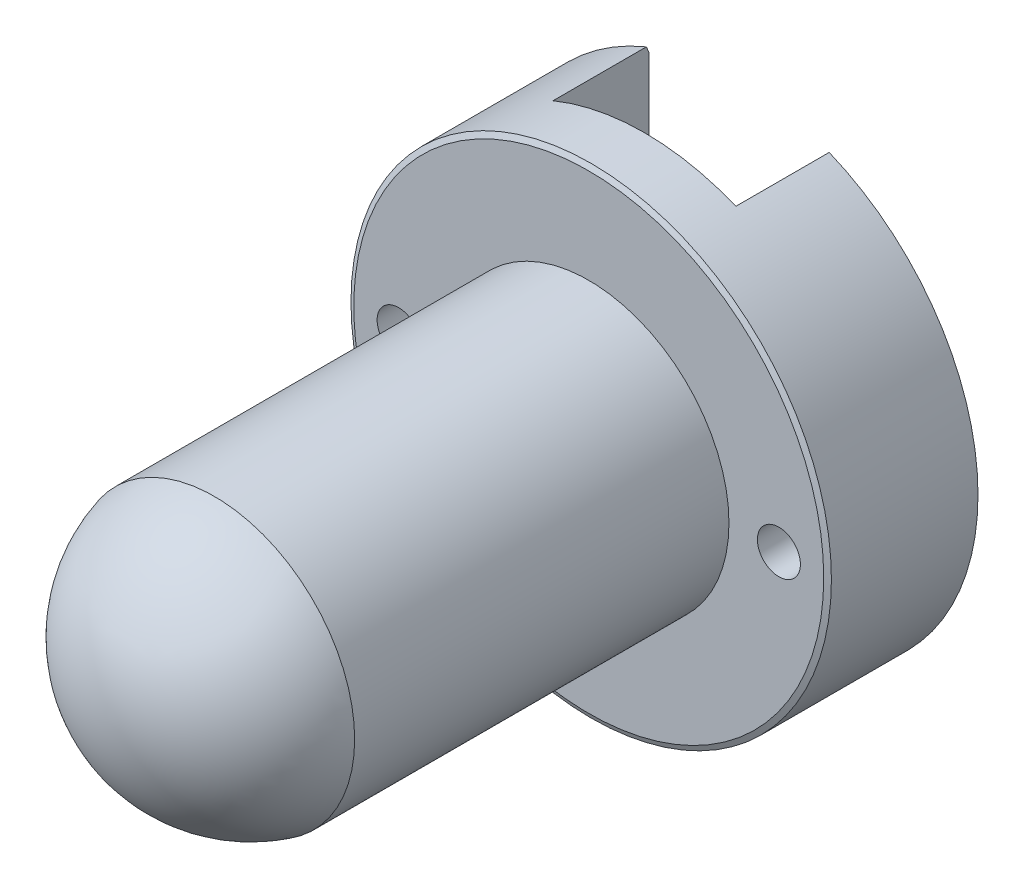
ISO-10303-21;
HEADER;
FILE_DESCRIPTION(('STEP AP214'),'2;1');
FILE_NAME('part.step','',(''),(''),'','','');
FILE_SCHEMA(('AUTOMOTIVE_DESIGN { 1 0 10303 214 1 1 1 1 }'));
ENDSEC;
DATA;
#1=APPLICATION_CONTEXT('core data for automotive mechanical design processes');
#2=APPLICATION_PROTOCOL_DEFINITION('international standard','automotive_design',2000,#1);
#3=PRODUCT_CONTEXT('',#1,'mechanical');
#4=PRODUCT('Part','Part','',(#3));
#5=PRODUCT_RELATED_PRODUCT_CATEGORY('part','',(#4));
#6=PRODUCT_DEFINITION_FORMATION('','',#4);
#7=PRODUCT_DEFINITION_CONTEXT('part definition',#1,'design');
#8=PRODUCT_DEFINITION('design','',#6,#7);
#9=PRODUCT_DEFINITION_SHAPE('','',#8);
#10=(LENGTH_UNIT() NAMED_UNIT(*) SI_UNIT(.MILLI.,.METRE.));
#11=(NAMED_UNIT(*) PLANE_ANGLE_UNIT() SI_UNIT($,.RADIAN.));
#12=(NAMED_UNIT(*) SI_UNIT($,.STERADIAN.) SOLID_ANGLE_UNIT());
#13=UNCERTAINTY_MEASURE_WITH_UNIT(LENGTH_MEASURE(1.E-05),#10,'distance_accuracy_value','');
#14=(GEOMETRIC_REPRESENTATION_CONTEXT(3) GLOBAL_UNCERTAINTY_ASSIGNED_CONTEXT((#13)) GLOBAL_UNIT_ASSIGNED_CONTEXT((#10,
#11,#12)) REPRESENTATION_CONTEXT('',''));
#15=CARTESIAN_POINT('',(0.,0.,0.));
#16=DIRECTION('',(0.,0.,1.));
#17=DIRECTION('',(1.,0.,0.));
#18=AXIS2_PLACEMENT_3D('',#15,#16,#17);
#19=CARTESIAN_POINT('',(0.,0.,23.622));
#20=DIRECTION('',(0.,0.,-1.));
#21=DIRECTION('',(-1.,0.,0.));
#22=AXIS2_PLACEMENT_3D('',#19,#20,#21);
#23=CYLINDRICAL_SURFACE('',#22,37.465);
#24=CARTESIAN_POINT('',(0.,0.,0.380999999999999));
#25=DIRECTION('',(0.,0.,1.));
#26=DIRECTION('',(1.,0.,0.));
#27=AXIS2_PLACEMENT_3D('',#24,#25,#26);
#28=CIRCLE('',#27,37.465);
#29=CARTESIAN_POINT('',(-14.2566195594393,34.6464287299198,0.380999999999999));
#30=VERTEX_POINT('',#29);
#31=CARTESIAN_POINT('',(14.2566195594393,34.6464287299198,0.380999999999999));
#32=VERTEX_POINT('',#31);
#33=EDGE_CURVE('E171',#30,#32,#28,.T.);
#34=ORIENTED_EDGE('',*,*,#33,.T.);
#35=DIRECTION('',(0.,0.,-1.));
#36=VECTOR('',#35,1.);
#37=CARTESIAN_POINT('',(14.2566195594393,34.6464287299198,23.622));
#38=LINE('',#37,#36);
#39=CARTESIAN_POINT('',(14.2566195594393,34.6464287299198,14.9352));
#40=VERTEX_POINT('',#39);
#41=EDGE_CURVE('E57',#32,#40,#38,.F.);
#42=ORIENTED_EDGE('',*,*,#41,.T.);
#43=CARTESIAN_POINT('',(0.,0.,14.9352));
#44=DIRECTION('',(0.,0.,1.));
#45=DIRECTION('',(1.,0.,0.));
#46=AXIS2_PLACEMENT_3D('',#43,#44,#45);
#47=CIRCLE('',#46,37.465);
#48=CARTESIAN_POINT('',(-14.2566195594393,34.6464287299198,14.9352));
#49=VERTEX_POINT('',#48);
#50=EDGE_CURVE('E11',#40,#49,#47,.T.);
#51=ORIENTED_EDGE('',*,*,#50,.T.);
#52=DIRECTION('',(0.,0.,-1.));
#53=VECTOR('',#52,1.);
#54=CARTESIAN_POINT('',(-14.2566195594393,34.6464287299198,23.622));
#55=LINE('',#54,#53);
#56=EDGE_CURVE('E137',#49,#30,#55,.T.);
#57=ORIENTED_EDGE('',*,*,#56,.T.);
#58=EDGE_LOOP('',(#34,#42,#51,#57));
#59=FACE_BOUND('',#58,.T.);
#60=CARTESIAN_POINT('',(0.,0.,23.241));
#61=DIRECTION('',(0.,0.,1.));
#62=DIRECTION('',(1.,0.,0.));
#63=AXIS2_PLACEMENT_3D('',#60,#61,#62);
#64=CIRCLE('',#63,37.465);
#65=CARTESIAN_POINT('',(37.465,0.,23.241));
#66=VERTEX_POINT('',#65);
#67=EDGE_CURVE('E168',#66,#66,#64,.F.);
#68=ORIENTED_EDGE('',*,*,#67,.T.);
#69=EDGE_LOOP('',(#68));
#70=FACE_BOUND('',#69,.T.);
#71=ADVANCED_FACE('F35',(#59,#70),#23,.T.);
#72=CARTESIAN_POINT('',(0.,0.,23.622));
#73=DIRECTION('',(0.,0.,1.));
#74=DIRECTION('',(1.,0.,0.));
#75=AXIS2_PLACEMENT_3D('',#72,#73,#74);
#76=PLANE('',#75);
#77=CARTESIAN_POINT('',(-29.6545,0.,23.622));
#78=DIRECTION('',(0.,0.,1.));
#79=DIRECTION('',(1.,0.,0.));
#80=AXIS2_PLACEMENT_3D('',#77,#78,#79);
#81=CIRCLE('',#80,3.3528);
#82=CARTESIAN_POINT('',(-26.3017,0.,23.622));
#83=VERTEX_POINT('',#82);
#84=EDGE_CURVE('E147',#83,#83,#81,.T.);
#85=ORIENTED_EDGE('',*,*,#84,.F.);
#86=EDGE_LOOP('',(#85));
#87=FACE_BOUND('',#86,.T.);
#88=CARTESIAN_POINT('',(29.6545,0.,23.622));
#89=DIRECTION('',(0.,0.,1.));
#90=DIRECTION('',(1.,0.,0.));
#91=AXIS2_PLACEMENT_3D('',#88,#89,#90);
#92=CIRCLE('',#91,3.3528);
#93=CARTESIAN_POINT('',(33.0073,0.,23.622));
#94=VERTEX_POINT('',#93);
#95=EDGE_CURVE('E153',#94,#94,#92,.T.);
#96=ORIENTED_EDGE('',*,*,#95,.F.);
#97=EDGE_LOOP('',(#96));
#98=FACE_BOUND('',#97,.T.);
#99=CARTESIAN_POINT('',(0.,0.,23.622));
#100=DIRECTION('',(0.,0.,1.));
#101=DIRECTION('',(1.,0.,0.));
#102=AXIS2_PLACEMENT_3D('',#99,#100,#101);
#103=CIRCLE('',#102,21.8694);
#104=CARTESIAN_POINT('',(21.8694,0.,23.622));
#105=VERTEX_POINT('',#104);
#106=EDGE_CURVE('E176',#105,#105,#103,.T.);
#107=ORIENTED_EDGE('',*,*,#106,.F.);
#108=EDGE_LOOP('',(#107));
#109=FACE_BOUND('',#108,.T.);
#110=CARTESIAN_POINT('',(0.,0.,23.622));
#111=DIRECTION('',(0.,0.,1.));
#112=DIRECTION('',(1.,0.,0.));
#113=AXIS2_PLACEMENT_3D('',#110,#111,#112);
#114=CIRCLE('',#113,36.6479428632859);
#115=CARTESIAN_POINT('',(36.6479428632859,0.,23.622));
#116=VERTEX_POINT('',#115);
#117=EDGE_CURVE('E165',#116,#116,#114,.T.);
#118=ORIENTED_EDGE('',*,*,#117,.T.);
#119=EDGE_LOOP('',(#118));
#120=FACE_BOUND('',#119,.T.);
#121=ADVANCED_FACE('F262',(#87,#98,#109,#120),#76,.T.);
#122=CARTESIAN_POINT('',(0.,0.,0.));
#123=DIRECTION('',(0.,0.,1.));
#124=DIRECTION('',(1.,0.,0.));
#125=AXIS2_PLACEMENT_3D('',#122,#123,#124);
#126=PLANE('',#125);
#127=CARTESIAN_POINT('',(-29.6545,0.,0.));
#128=DIRECTION('',(0.,0.,-1.));
#129=DIRECTION('',(1.,0.,0.));
#130=AXIS2_PLACEMENT_3D('',#127,#128,#129);
#131=CIRCLE('',#130,3.3528);
#132=CARTESIAN_POINT('',(-26.3017,0.,0.));
#133=VERTEX_POINT('',#132);
#134=EDGE_CURVE('E144',#133,#133,#131,.T.);
#135=ORIENTED_EDGE('',*,*,#134,.F.);
#136=EDGE_LOOP('',(#135));
#137=FACE_BOUND('',#136,.T.);
#138=CARTESIAN_POINT('',(29.6545,0.,0.));
#139=DIRECTION('',(0.,0.,-1.));
#140=DIRECTION('',(-1.,0.,0.));
#141=AXIS2_PLACEMENT_3D('',#138,#139,#140);
#142=CIRCLE('',#141,3.3528);
#143=CARTESIAN_POINT('',(26.3017,0.,0.));
#144=VERTEX_POINT('',#143);
#145=EDGE_CURVE('E150',#144,#144,#142,.T.);
#146=ORIENTED_EDGE('',*,*,#145,.F.);
#147=EDGE_LOOP('',(#146));
#148=FACE_BOUND('',#147,.T.);
#149=CARTESIAN_POINT('',(11.7166195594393,-10.6925712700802,0.));
#150=DIRECTION('',(0.,0.,-1.));
#151=DIRECTION('',(1.,0.,0.));
#152=AXIS2_PLACEMENT_3D('',#149,#150,#151);
#153=CIRCLE('',#152,2.54);
#154=CARTESIAN_POINT('',(14.2566195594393,-10.6925712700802,0.));
#155=VERTEX_POINT('',#154);
#156=CARTESIAN_POINT('',(11.7166195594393,-13.2325712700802,0.));
#157=VERTEX_POINT('',#156);
#158=EDGE_CURVE('E102',#155,#157,#153,.T.);
#159=ORIENTED_EDGE('',*,*,#158,.F.);
#160=DIRECTION('',(0.,-1.,0.));
#161=VECTOR('',#160,1.);
#162=CARTESIAN_POINT('',(14.2566195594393,40.4285272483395,0.));
#163=LINE('',#162,#161);
#164=CARTESIAN_POINT('',(14.2566195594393,33.7612279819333,0.));
#165=VERTEX_POINT('',#164);
#166=EDGE_CURVE('E93',#165,#155,#163,.T.);
#167=ORIENTED_EDGE('',*,*,#166,.F.);
#168=CARTESIAN_POINT('',(0.,0.,0.));
#169=DIRECTION('',(0.,0.,1.));
#170=DIRECTION('',(1.,0.,0.));
#171=AXIS2_PLACEMENT_3D('',#168,#169,#170);
#172=CIRCLE('',#171,36.6479428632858);
#173=CARTESIAN_POINT('',(-14.2566195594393,33.7612279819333,0.));
#174=VERTEX_POINT('',#173);
#175=EDGE_CURVE('E174',#165,#174,#172,.F.);
#176=ORIENTED_EDGE('',*,*,#175,.T.);
#177=DIRECTION('',(0.,1.,0.));
#178=VECTOR('',#177,1.);
#179=CARTESIAN_POINT('',(-14.2566195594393,40.4285272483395,0.));
#180=LINE('',#179,#178);
#181=CARTESIAN_POINT('',(-14.2566195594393,-10.6925712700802,0.));
#182=VERTEX_POINT('',#181);
#183=EDGE_CURVE('E49',#182,#174,#180,.T.);
#184=ORIENTED_EDGE('',*,*,#183,.F.);
#185=CARTESIAN_POINT('',(-11.7166195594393,-10.6925712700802,0.));
#186=DIRECTION('',(0.,0.,-1.));
#187=DIRECTION('',(-1.,0.,0.));
#188=AXIS2_PLACEMENT_3D('',#185,#186,#187);
#189=CIRCLE('',#188,2.54);
#190=CARTESIAN_POINT('',(-11.7166195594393,-13.2325712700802,0.));
#191=VERTEX_POINT('',#190);
#192=EDGE_CURVE('E118',#191,#182,#189,.T.);
#193=ORIENTED_EDGE('',*,*,#192,.F.);
#194=DIRECTION('',(-1.,0.,0.));
#195=VECTOR('',#194,1.);
#196=CARTESIAN_POINT('',(11.7166195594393,-13.2325712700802,0.));
#197=LINE('',#196,#195);
#198=EDGE_CURVE('E116',#157,#191,#197,.T.);
#199=ORIENTED_EDGE('',*,*,#198,.F.);
#200=EDGE_LOOP('',(#159,#167,#176,#184,#193,#199));
#201=FACE_BOUND('',#200,.T.);
#202=ADVANCED_FACE('F113',(#137,#148,#201),#126,.F.);
#203=CARTESIAN_POINT('',(0.,0.,23.622));
#204=DIRECTION('',(0.,0.,-1.));
#205=DIRECTION('',(-1.,0.,0.));
#206=AXIS2_PLACEMENT_3D('',#203,#204,#205);
#207=CONICAL_SURFACE('',#206,36.6479428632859,1.13446401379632);
#208=ORIENTED_EDGE('',*,*,#67,.F.);
#209=EDGE_LOOP('',(#208));
#210=FACE_BOUND('',#209,.T.);
#211=ORIENTED_EDGE('',*,*,#117,.F.);
#212=EDGE_LOOP('',(#211));
#213=FACE_BOUND('',#212,.T.);
#214=ADVANCED_FACE('F296',(#210,#213),#207,.T.);
#215=CARTESIAN_POINT('',(0.,0.,0.380999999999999));
#216=DIRECTION('',(0.,0.,1.));
#217=DIRECTION('',(1.,0.,0.));
#218=AXIS2_PLACEMENT_3D('',#215,#216,#217);
#219=CONICAL_SURFACE('',#218,37.465,1.13446401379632);
#220=CARTESIAN_POINT('',(14.2566195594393,66.3606470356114,14.5613164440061));
#221=CARTESIAN_POINT('',(14.2566195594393,64.6380920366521,13.7760422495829));
#222=CARTESIAN_POINT('',(14.2566195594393,62.9150608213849,12.9918090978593));
#223=CARTESIAN_POINT('',(14.2566195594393,59.4676862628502,11.4261750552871));
#224=CARTESIAN_POINT('',(14.2566195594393,57.7433429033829,10.6447742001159));
#225=CARTESIAN_POINT('',(14.2566195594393,54.2911616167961,9.08473144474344));
#226=CARTESIAN_POINT('',(14.2566195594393,52.563321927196,8.30609344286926));
#227=CARTESIAN_POINT('',(14.2566195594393,49.1055197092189,6.75358400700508));
#228=CARTESIAN_POINT('',(14.2566195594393,47.3755572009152,5.97971252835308));
#229=CARTESIAN_POINT('',(14.2566195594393,44.6655491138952,4.77349228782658));
#230=CARTESIAN_POINT('',(14.2566195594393,43.6864814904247,4.33894653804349));
#231=CARTESIAN_POINT('',(14.2566195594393,41.7272437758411,3.47234817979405));
#232=CARTESIAN_POINT('',(14.2566195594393,40.7470736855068,3.04029556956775));
#233=CARTESIAN_POINT('',(14.2566195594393,38.785370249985,2.17920369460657));
#234=CARTESIAN_POINT('',(14.2566195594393,37.8038368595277,1.75016453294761));
#235=CARTESIAN_POINT('',(14.2566195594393,35.839148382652,0.895816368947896));
#236=CARTESIAN_POINT('',(14.2566195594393,34.8559932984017,0.470507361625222));
#237=CARTESIAN_POINT('',(14.2566195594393,32.8885343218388,-0.375086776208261));
#238=CARTESIAN_POINT('',(14.2566195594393,31.9042321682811,-0.795375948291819));
#239=CARTESIAN_POINT('',(14.2566195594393,29.9331220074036,-1.63006235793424));
#240=CARTESIAN_POINT('',(14.2566195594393,28.9463139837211,-2.04445955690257));
#241=CARTESIAN_POINT('',(14.2566195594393,26.9695824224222,-2.86562685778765));
#242=CARTESIAN_POINT('',(14.2566195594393,25.9796590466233,-3.27239734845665));
#243=CARTESIAN_POINT('',(14.2566195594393,23.9957658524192,-4.07592346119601));
#244=CARTESIAN_POINT('',(14.2566195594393,23.0017961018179,-4.47267925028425));
#245=CARTESIAN_POINT('',(14.2566195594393,21.0840529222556,-5.22320136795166));
#246=CARTESIAN_POINT('',(14.2566195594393,20.1606649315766,-5.57794767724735));
#247=CARTESIAN_POINT('',(14.2566195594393,18.7712219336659,-6.09844886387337));
#248=CARTESIAN_POINT('',(14.2566195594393,18.3073432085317,-6.27001438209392));
#249=CARTESIAN_POINT('',(14.2566195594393,17.3779273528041,-6.60860274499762));
#250=CARTESIAN_POINT('',(14.2566195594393,16.9123902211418,-6.77562558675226));
#251=CARTESIAN_POINT('',(14.2566195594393,15.9782805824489,-7.10475555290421));
#252=CARTESIAN_POINT('',(14.2566195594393,15.5097034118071,-7.26684946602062));
#253=CARTESIAN_POINT('',(14.2566195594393,14.5704089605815,-7.58473148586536));
#254=CARTESIAN_POINT('',(14.2566195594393,14.0996916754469,-7.74051957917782));
#255=CARTESIAN_POINT('',(14.2566195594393,13.1558084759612,-8.04464961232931));
#256=CARTESIAN_POINT('',(14.2566195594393,12.6826423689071,-8.19299095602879));
#257=CARTESIAN_POINT('',(14.2566195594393,11.7336213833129,-8.48082912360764));
#258=CARTESIAN_POINT('',(14.2566195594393,11.2577665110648,-8.62032596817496));
#259=CARTESIAN_POINT('',(14.2566195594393,10.3233982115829,-8.88311706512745));
#260=CARTESIAN_POINT('',(14.2566195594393,9.86500860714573,-9.00684820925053));
#261=CARTESIAN_POINT('',(14.2566195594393,8.94534912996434,-9.24300123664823));
#262=CARTESIAN_POINT('',(14.2566195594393,8.48407925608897,-9.35542311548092));
#263=CARTESIAN_POINT('',(14.2566195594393,7.09562559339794,-9.67289297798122));
#264=CARTESIAN_POINT('',(14.2566195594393,6.16367600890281,-9.85818044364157));
#265=CARTESIAN_POINT('',(14.2566195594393,4.76012948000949,-10.0834409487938));
#266=CARTESIAN_POINT('',(14.2566195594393,4.29268124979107,-10.1496351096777));
#267=CARTESIAN_POINT('',(14.2566195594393,3.35543601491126,-10.2628577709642));
#268=CARTESIAN_POINT('',(14.2566195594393,2.88563904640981,-10.3098865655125));
#269=CARTESIAN_POINT('',(14.2566195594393,1.94459534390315,-10.3831741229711));
#270=CARTESIAN_POINT('',(14.2566195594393,1.47334923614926,-10.409440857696));
#271=CARTESIAN_POINT('',(14.2566195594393,0.530140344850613,-10.4402682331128));
#272=CARTESIAN_POINT('',(14.2566195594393,0.0581775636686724,-10.4448289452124));
#273=CARTESIAN_POINT('',(14.2566195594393,-0.898390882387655,-10.4318920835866));
#274=CARTESIAN_POINT('',(14.2566195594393,-1.38298831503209,-10.4137861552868));
#275=CARTESIAN_POINT('',(14.2566195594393,-2.35081965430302,-10.3551907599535));
#276=CARTESIAN_POINT('',(14.2566195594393,-2.83405353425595,-10.3147008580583));
#277=CARTESIAN_POINT('',(14.2566195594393,-3.79852287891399,-10.2128122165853));
#278=CARTESIAN_POINT('',(14.2566195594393,-4.27975726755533,-10.1514034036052));
#279=CARTESIAN_POINT('',(14.2566195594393,-5.23941490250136,-10.0096983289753));
#280=CARTESIAN_POINT('',(14.2566195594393,-5.71783811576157,-9.92940184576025));
#281=CARTESIAN_POINT('',(14.2566195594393,-6.67453150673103,-9.75161946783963));
#282=CARTESIAN_POINT('',(14.2566195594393,-7.15278224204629,-9.65402981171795));
#283=CARTESIAN_POINT('',(14.2566195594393,-8.10605885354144,-9.44429137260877));
#284=CARTESIAN_POINT('',(14.2566195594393,-8.58108472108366,-9.33214255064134));
#285=CARTESIAN_POINT('',(14.2566195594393,-9.5279625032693,-9.09542535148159));
#286=CARTESIAN_POINT('',(14.2566195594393,-9.9998147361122,-8.97085823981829));
#287=CARTESIAN_POINT('',(14.2566195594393,-10.9405952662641,-8.71118356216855));
#288=CARTESIAN_POINT('',(14.2566195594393,-11.409523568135,-8.57607601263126));
#289=CARTESIAN_POINT('',(14.2566195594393,-12.3598346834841,-8.29243453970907));
#290=CARTESIAN_POINT('',(14.2566195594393,-12.8411297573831,-8.14360769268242));
#291=CARTESIAN_POINT('',(14.2566195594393,-13.8011693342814,-7.83796769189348));
#292=CARTESIAN_POINT('',(14.2566195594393,-14.2799138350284,-7.68115453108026));
#293=CARTESIAN_POINT('',(14.2566195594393,-15.2351146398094,-7.36080674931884));
#294=CARTESIAN_POINT('',(14.2566195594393,-15.7115710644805,-7.19727248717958));
#295=CARTESIAN_POINT('',(14.2566195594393,-16.662487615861,-6.86451349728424));
#296=CARTESIAN_POINT('',(14.2566195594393,-17.1369477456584,-6.69528877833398));
#297=CARTESIAN_POINT('',(14.2566195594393,-18.0828499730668,-6.35246535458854));
#298=CARTESIAN_POINT('',(14.2566195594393,-18.5542967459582,-6.17887952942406));
#299=CARTESIAN_POINT('',(14.2566195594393,-19.4956581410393,-5.8275981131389));
#300=CARTESIAN_POINT('',(14.2566195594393,-19.9655727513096,-5.64990249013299));
#301=CARTESIAN_POINT('',(14.2566195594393,-21.3732834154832,-5.11156104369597));
#302=CARTESIAN_POINT('',(14.2566195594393,-22.3090681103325,-4.745652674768));
#303=CARTESIAN_POINT('',(14.2566195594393,-23.9443355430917,-4.09563322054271));
#304=CARTESIAN_POINT('',(14.2566195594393,-24.6447293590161,-3.81380129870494));
#305=CARTESIAN_POINT('',(14.2566195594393,-26.0435515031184,-3.24529652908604));
#306=CARTESIAN_POINT('',(14.2566195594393,-26.7419798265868,-2.95862366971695));
#307=CARTESIAN_POINT('',(14.2566195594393,-28.1376104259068,-2.38112436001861));
#308=CARTESIAN_POINT('',(14.2566195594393,-28.8348117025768,-2.0902954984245));
#309=CARTESIAN_POINT('',(14.2566195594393,-30.227822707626,-1.50532338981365));
#310=CARTESIAN_POINT('',(14.2566195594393,-30.9236324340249,-1.21118013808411));
#311=CARTESIAN_POINT('',(14.2566195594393,-32.2849790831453,-0.632478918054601));
#312=CARTESIAN_POINT('',(14.2566195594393,-32.9505644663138,-0.348034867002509));
#313=CARTESIAN_POINT('',(14.2566195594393,-34.2808004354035,0.223029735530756));
#314=CARTESIAN_POINT('',(14.2566195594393,-34.9454510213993,0.509650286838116));
#315=CARTESIAN_POINT('',(14.2566195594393,-36.2735247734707,1.08457544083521));
#316=CARTESIAN_POINT('',(14.2566195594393,-36.9369484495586,1.37287886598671));
#317=CARTESIAN_POINT('',(14.2566195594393,-38.2630882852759,1.9511039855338));
#318=CARTESIAN_POINT('',(14.2566195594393,-38.9258044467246,2.24102567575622));
#319=CARTESIAN_POINT('',(14.2566195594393,-39.5882183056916,2.53163475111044));
#320=B_SPLINE_CURVE_WITH_KNOTS('',3,(#220,#221,#222,#223,#224,#225,#226,#227,#228,#229,#230,
#231,#232,#233,#234,#235,#236,#237,#238,#239,#240,#241,#242,#243,#244,#245,#246,#247,#248,#249,
#250,#251,#252,#253,#254,#255,#256,#257,#258,#259,#260,#261,#262,#263,#264,#265,#266,#267,#268,
#269,#270,#271,#272,#273,#274,#275,#276,#277,#278,#279,#280,#281,#282,#283,#284,#285,#286,#287,
#288,#289,#290,#291,#292,#293,#294,#295,#296,#297,#298,#299,#300,#301,#302,#303,#304,#305,#306,
#307,#308,#309,#310,#311,#312,#313,#314,#315,#316,#317,#318,#319),.UNSPECIFIED.,.F.,.F.,(4,2,2,
2,2,2,2,2,2,2,2,2,2,2,2,2,2,2,2,2,2,2,2,2,2,2,2,2,2,2,2,2,2,2,2,2,2,2,2,2,2,2,2,2,2,2,2,2,2,4),
(0.,5.67932068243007,11.3587126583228,17.0442476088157,22.7297292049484,25.9432340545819,
29.1567366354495,32.370348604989,35.5839562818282,38.7947735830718,42.0056119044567,
45.2162861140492,48.4269067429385,51.394348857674,52.8780968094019,54.3618457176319,
55.8492725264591,57.3367024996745,58.824251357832,60.3117967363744,61.7360364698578,
63.1602767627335,66.0083774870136,67.4243942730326,68.8403893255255,70.2558404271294,
71.6712868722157,73.125550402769,74.5798421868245,76.0348352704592,77.4898454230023,
78.9539012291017,80.4179609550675,81.8818716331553,83.3457800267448,84.8570375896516,
86.368296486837,87.8794748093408,89.3906507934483,90.8977934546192,92.4049478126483,
95.4191868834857,97.6840826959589,99.9489839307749,102.215257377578,104.481534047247,
106.652983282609,108.824432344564,110.994510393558,113.164582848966),.UNSPECIFIED.);
#321=EDGE_CURVE('E42',#32,#165,#320,.T.);
#322=ORIENTED_EDGE('',*,*,#321,.F.);
#323=ORIENTED_EDGE('',*,*,#33,.F.);
#324=CARTESIAN_POINT('',(-14.2566195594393,-39.5882183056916,2.53163475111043));
#325=CARTESIAN_POINT('',(-14.2566195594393,-39.0352843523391,2.28905053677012));
#326=CARTESIAN_POINT('',(-14.2566195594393,-38.4821378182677,2.04695138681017));
#327=CARTESIAN_POINT('',(-14.2566195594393,-37.375364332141,1.56385420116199));
#328=CARTESIAN_POINT('',(-14.2566195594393,-36.8217373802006,1.32285616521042));
#329=CARTESIAN_POINT('',(-14.2566195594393,-35.1599883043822,0.601682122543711));
#330=CARTESIAN_POINT('',(-14.2566195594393,-34.0510621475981,0.123354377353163));
#331=CARTESIAN_POINT('',(-14.2566195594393,-32.3842560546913,-0.589944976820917));
#332=CARTESIAN_POINT('',(-14.2566195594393,-31.8273966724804,-0.827302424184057));
#333=CARTESIAN_POINT('',(-14.2566195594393,-30.7128993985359,-1.30017496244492));
#334=CARTESIAN_POINT('',(-14.2566195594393,-30.1552615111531,-1.53569006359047));
#335=CARTESIAN_POINT('',(-14.2566195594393,-29.0391190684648,-2.00459255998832));
#336=CARTESIAN_POINT('',(-14.2566195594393,-28.4806145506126,-2.23798004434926));
#337=CARTESIAN_POINT('',(-14.2566195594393,-27.3625745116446,-2.70230603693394));
#338=CARTESIAN_POINT('',(-14.2566195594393,-26.8030389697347,-2.9332444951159));
#339=CARTESIAN_POINT('',(-14.2566195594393,-25.6437938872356,-3.40824299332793));
#340=CARTESIAN_POINT('',(-14.2566195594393,-25.0439998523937,-3.65209701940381));
#341=CARTESIAN_POINT('',(-14.2566195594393,-23.842848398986,-4.13592286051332));
#342=CARTESIAN_POINT('',(-14.2566195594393,-23.2414909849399,-4.3758946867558));
#343=CARTESIAN_POINT('',(-14.2566195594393,-22.0369584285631,-4.85118795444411));
#344=CARTESIAN_POINT('',(-14.2566195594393,-21.4337833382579,-5.0865095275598));
#345=CARTESIAN_POINT('',(-14.2566195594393,-20.2252801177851,-5.5515489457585));
#346=CARTESIAN_POINT('',(-14.2566195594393,-19.6199520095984,-5.78126684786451));
#347=CARTESIAN_POINT('',(-14.2566195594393,-18.4072355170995,-6.23370575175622));
#348=CARTESIAN_POINT('',(-14.2566195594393,-17.7998491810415,-6.45643223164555));
#349=CARTESIAN_POINT('',(-14.2566195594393,-16.5820600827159,-6.89354290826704));
#350=CARTESIAN_POINT('',(-14.2566195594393,-15.9716572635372,-7.10792694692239));
#351=CARTESIAN_POINT('',(-14.2566195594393,-14.7474470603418,-7.52632763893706));
#352=CARTESIAN_POINT('',(-14.2566195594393,-14.1336404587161,-7.73034657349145));
#353=CARTESIAN_POINT('',(-14.2566195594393,-12.9019208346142,-8.1255393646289));
#354=CARTESIAN_POINT('',(-14.2566195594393,-12.2840080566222,-8.31671397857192));
#355=CARTESIAN_POINT('',(-14.2566195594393,-11.1415992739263,-8.65403079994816));
#356=CARTESIAN_POINT('',(-14.2566195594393,-10.6177962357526,-8.80251152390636));
#357=CARTESIAN_POINT('',(-14.2566195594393,-9.56646784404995,-9.08576294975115));
#358=CARTESIAN_POINT('',(-14.2566195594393,-9.03894246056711,-9.22053354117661));
#359=CARTESIAN_POINT('',(-14.2566195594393,-7.98001543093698,-9.47360786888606));
#360=CARTESIAN_POINT('',(-14.2566195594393,-7.44861441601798,-9.59191422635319));
#361=CARTESIAN_POINT('',(-14.2566195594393,-6.38180644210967,-9.80901374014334));
#362=CARTESIAN_POINT('',(-14.2566195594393,-5.8463995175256,-9.90780706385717));
#363=CARTESIAN_POINT('',(-14.2566195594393,-4.78249196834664,-10.0809363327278));
#364=CARTESIAN_POINT('',(-14.2566195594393,-4.2540646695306,-10.1557180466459));
#365=CARTESIAN_POINT('',(-14.2566195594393,-3.1942805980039,-10.2806142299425));
#366=CARTESIAN_POINT('',(-14.2566195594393,-2.66292391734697,-10.3307294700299));
#367=CARTESIAN_POINT('',(-14.2566195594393,-1.59854509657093,-10.4040857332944));
#368=CARTESIAN_POINT('',(-14.2566195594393,-1.0655237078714,-10.4273375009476));
#369=CARTESIAN_POINT('',(-14.2566195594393,0.00100996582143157,-10.4458906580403));
#370=CARTESIAN_POINT('',(-14.2566195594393,0.534522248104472,-10.4411922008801));
#371=CARTESIAN_POINT('',(-14.2566195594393,1.60107455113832,-10.4040574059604));
#372=CARTESIAN_POINT('',(-14.2566195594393,2.13411363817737,-10.3715946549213));
#373=CARTESIAN_POINT('',(-14.2566195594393,3.19792271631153,-10.2804158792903));
#374=CARTESIAN_POINT('',(-14.2566195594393,3.72869264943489,-10.2216991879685));
#375=CARTESIAN_POINT('',(-14.2566195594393,4.78732028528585,-10.0804387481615));
#376=CARTESIAN_POINT('',(-14.2566195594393,5.3151761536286,-9.99788142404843));
#377=CARTESIAN_POINT('',(-14.2566195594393,6.36716906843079,-9.81190310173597));
#378=CARTESIAN_POINT('',(-14.2566195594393,6.89130604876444,-9.70848173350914));
#379=CARTESIAN_POINT('',(-14.2566195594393,7.94838431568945,-9.48107125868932));
#380=CARTESIAN_POINT('',(-14.2566195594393,8.48123053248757,-9.35664387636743));
#381=CARTESIAN_POINT('',(-14.2566195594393,9.54298350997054,-9.09209669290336));
#382=CARTESIAN_POINT('',(-14.2566195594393,10.0718902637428,-8.95197686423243));
#383=CARTESIAN_POINT('',(-14.2566195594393,11.1259804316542,-8.65871793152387));
#384=CARTESIAN_POINT('',(-14.2566195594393,11.651164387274,-8.50558076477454));
#385=CARTESIAN_POINT('',(-14.2566195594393,12.4364599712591,-8.26777483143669));
#386=CARTESIAN_POINT('',(-14.2566195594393,12.697809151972,-8.18715701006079));
#387=CARTESIAN_POINT('',(-14.2566195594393,13.2197332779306,-8.02345596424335));
#388=CARTESIAN_POINT('',(-14.2566195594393,13.4803082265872,-7.94037275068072));
#389=CARTESIAN_POINT('',(-14.2566195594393,14.3464565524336,-7.66009516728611));
#390=CARTESIAN_POINT('',(-14.2566195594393,14.9504309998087,-7.45795019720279));
#391=CARTESIAN_POINT('',(-14.2566195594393,16.1550261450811,-7.0438781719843));
#392=CARTESIAN_POINT('',(-14.2566195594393,16.7556467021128,-6.83195070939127));
#393=CARTESIAN_POINT('',(-14.2566195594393,17.9541118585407,-6.40011991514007));
#394=CARTESIAN_POINT('',(-14.2566195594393,18.551956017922,-6.18021536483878));
#395=CARTESIAN_POINT('',(-14.2566195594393,19.7451994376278,-5.73390956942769));
#396=CARTESIAN_POINT('',(-14.2566195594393,20.3405987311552,-5.50750841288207));
#397=CARTESIAN_POINT('',(-14.2566195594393,21.5296545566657,-5.049217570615));
#398=CARTESIAN_POINT('',(-14.2566195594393,22.1233099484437,-4.8173249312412));
#399=CARTESIAN_POINT('',(-14.2566195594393,23.3088564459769,-4.34907384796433));
#400=CARTESIAN_POINT('',(-14.2566195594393,23.9007475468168,-4.11271539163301));
#401=CARTESIAN_POINT('',(-14.2566195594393,25.0829713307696,-3.63627506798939));
#402=CARTESIAN_POINT('',(-14.2566195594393,25.6733041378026,-3.39619350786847));
#403=CARTESIAN_POINT('',(-14.2566195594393,26.8526726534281,-2.91286349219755));
#404=CARTESIAN_POINT('',(-14.2566195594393,27.4417083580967,-2.6696150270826));
#405=CARTESIAN_POINT('',(-14.2566195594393,29.2092553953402,-1.93497093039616));
#406=CARTESIAN_POINT('',(-14.2566195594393,30.3860875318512,-1.4395347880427));
#407=CARTESIAN_POINT('',(-14.2566195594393,32.736394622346,-0.440729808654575));
#408=CARTESIAN_POINT('',(-14.2566195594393,33.9098695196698,0.0626391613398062));
#409=CARTESIAN_POINT('',(-14.2566195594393,36.2538454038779,1.0752355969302));
#410=CARTESIAN_POINT('',(-14.2566195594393,37.4243472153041,1.58446115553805));
#411=CARTESIAN_POINT('',(-14.2566195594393,39.7633064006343,2.60756446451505));
#412=CARTESIAN_POINT('',(-14.2566195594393,40.9317637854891,3.12144218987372));
#413=CARTESIAN_POINT('',(-14.2566195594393,43.1151494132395,4.08577951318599));
#414=CARTESIAN_POINT('',(-14.2566195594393,44.1302751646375,4.53579223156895));
#415=CARTESIAN_POINT('',(-14.2566195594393,46.1595051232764,5.43811556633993));
#416=CARTESIAN_POINT('',(-14.2566195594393,47.1736093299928,5.89042618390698));
#417=CARTESIAN_POINT('',(-14.2566195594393,50.214837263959,7.25029523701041));
#418=CARTESIAN_POINT('',(-14.2566195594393,52.240685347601,8.16070634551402));
#419=CARTESIAN_POINT('',(-14.2566195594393,56.2833369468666,9.98396341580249));
#420=CARTESIAN_POINT('',(-14.2566195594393,58.3001484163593,10.8967917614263));
#421=CARTESIAN_POINT('',(-14.2566195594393,61.3239019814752,12.2689846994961));
#422=CARTESIAN_POINT('',(-14.2566195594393,62.3315245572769,12.7268506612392));
#423=CARTESIAN_POINT('',(-14.2566195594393,64.346370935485,13.6434578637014));
#424=CARTESIAN_POINT('',(-14.2566195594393,65.3535947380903,14.1021991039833));
#425=CARTESIAN_POINT('',(-14.2566195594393,66.3606470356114,14.5613164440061));
#426=B_SPLINE_CURVE_WITH_KNOTS('',3,(#324,#325,#326,#327,#328,#329,#330,#331,#332,#333,#334,
#335,#336,#337,#338,#339,#340,#341,#342,#343,#344,#345,#346,#347,#348,#349,#350,#351,#352,#353,
#354,#355,#356,#357,#358,#359,#360,#361,#362,#363,#364,#365,#366,#367,#368,#369,#370,#371,#372,
#373,#374,#375,#376,#377,#378,#379,#380,#381,#382,#383,#384,#385,#386,#387,#388,#389,#390,#391,
#392,#393,#394,#395,#396,#397,#398,#399,#400,#401,#402,#403,#404,#405,#406,#407,#408,#409,#410,
#411,#412,#413,#414,#415,#416,#417,#418,#419,#420,#421,#422,#423,#424,#425),.UNSPECIFIED.,.F.,
.F.,(4,2,2,2,2,2,2,2,2,2,2,2,2,2,2,2,2,2,2,2,2,2,2,2,2,2,2,2,2,2,2,2,2,2,2,2,2,2,2,2,2,2,2,2,2,
2,2,2,2,2,4),(0.,1.81142060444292,3.62284077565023,7.24589143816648,9.06189505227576,
10.8778885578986,12.6938056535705,14.5097597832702,16.4521590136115,18.3945526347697,
20.3368911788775,22.2792099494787,24.2199667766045,26.1607603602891,28.101124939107,
30.0413750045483,31.6745474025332,33.3077329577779,34.9406582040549,36.5735694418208,
38.1741296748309,39.7746398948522,41.3745097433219,42.9743708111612,44.5757555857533,
46.177181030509,47.779520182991,49.3818877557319,51.0231463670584,52.6644078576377,
54.3054255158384,55.1259178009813,55.9464064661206,57.8570027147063,59.7676786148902,
61.6786476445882,63.5895906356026,65.5015859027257,67.4135864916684,69.3254301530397,
71.2372795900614,75.0678370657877,78.8984588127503,82.727866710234,86.5572540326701,
89.8884555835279,93.2196588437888,99.8826918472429,106.524000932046,109.844316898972,
113.164631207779),.UNSPECIFIED.);
#427=EDGE_CURVE('E179',#174,#30,#426,.T.);
#428=ORIENTED_EDGE('',*,*,#427,.F.);
#429=ORIENTED_EDGE('',*,*,#175,.F.);
#430=EDGE_LOOP('',(#322,#323,#428,#429));
#431=FACE_BOUND('',#430,.T.);
#432=ADVANCED_FACE('F191',(#431),#219,.T.);
#433=CARTESIAN_POINT('',(0.,0.,0.));
#434=DIRECTION('',(0.,0.,-1.));
#435=DIRECTION('',(-1.,0.,0.));
#436=AXIS2_PLACEMENT_3D('',#433,#434,#435);
#437=CYLINDRICAL_SURFACE('',#436,21.8694);
#438=CARTESIAN_POINT('',(0.,0.,82.0003190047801));
#439=DIRECTION('',(0.,0.,-1.));
#440=DIRECTION('',(-1.,0.,0.));
#441=AXIS2_PLACEMENT_3D('',#438,#439,#440);
#442=CIRCLE('',#441,21.8694);
#443=CARTESIAN_POINT('',(-21.8694,0.,82.0003190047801));
#444=VERTEX_POINT('',#443);
#445=EDGE_CURVE('E156',#444,#444,#442,.T.);
#446=ORIENTED_EDGE('',*,*,#445,.T.);
#447=EDGE_LOOP('',(#446));
#448=FACE_BOUND('',#447,.T.);
#449=ORIENTED_EDGE('',*,*,#106,.T.);
#450=EDGE_LOOP('',(#449));
#451=FACE_BOUND('',#450,.T.);
#452=ADVANCED_FACE('F224',(#448,#451),#437,.T.);
#453=CARTESIAN_POINT('',(0.,0.,76.327));
#454=DIRECTION('',(0.,0.,-1.));
#455=DIRECTION('',(-1.,0.,0.));
#456=AXIS2_PLACEMENT_3D('',#453,#454,#455);
#457=SPHERICAL_SURFACE('',#456,22.5933);
#458=ORIENTED_EDGE('',*,*,#445,.F.);
#459=EDGE_LOOP('',(#458));
#460=FACE_BOUND('',#459,.T.);
#461=ADVANCED_FACE('F220',(#460),#457,.T.);
#462=CARTESIAN_POINT('',(29.6545,0.,98.9203));
#463=DIRECTION('',(0.,0.,-1.));
#464=DIRECTION('',(-1.,0.,0.));
#465=AXIS2_PLACEMENT_3D('',#462,#463,#464);
#466=CYLINDRICAL_SURFACE('',#465,3.3528);
#467=ORIENTED_EDGE('',*,*,#95,.T.);
#468=EDGE_LOOP('',(#467));
#469=FACE_BOUND('',#468,.T.);
#470=ORIENTED_EDGE('',*,*,#145,.T.);
#471=EDGE_LOOP('',(#470));
#472=FACE_BOUND('',#471,.T.);
#473=ADVANCED_FACE('F216',(#469,#472),#466,.F.);
#474=CARTESIAN_POINT('',(-29.6545,0.,98.9203));
#475=DIRECTION('',(0.,0.,-1.));
#476=DIRECTION('',(-1.,0.,0.));
#477=AXIS2_PLACEMENT_3D('',#474,#475,#476);
#478=CYLINDRICAL_SURFACE('',#477,3.3528);
#479=ORIENTED_EDGE('',*,*,#84,.T.);
#480=EDGE_LOOP('',(#479));
#481=FACE_BOUND('',#480,.T.);
#482=ORIENTED_EDGE('',*,*,#134,.T.);
#483=EDGE_LOOP('',(#482));
#484=FACE_BOUND('',#483,.T.);
#485=ADVANCED_FACE('F213',(#481,#484),#478,.F.);
#486=CARTESIAN_POINT('',(11.7166195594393,-10.6925712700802,14.9352));
#487=DIRECTION('',(0.,0.,1.));
#488=DIRECTION('',(1.,0.,0.));
#489=AXIS2_PLACEMENT_3D('',#486,#487,#488);
#490=PLANE('',#489);
#491=DIRECTION('',(0.,-1.,0.));
#492=VECTOR('',#491,1.);
#493=CARTESIAN_POINT('',(14.2566195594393,40.4285272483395,14.9352));
#494=LINE('',#493,#492);
#495=CARTESIAN_POINT('',(14.2566195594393,-10.6925712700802,14.9352));
#496=VERTEX_POINT('',#495);
#497=EDGE_CURVE('E124',#40,#496,#494,.T.);
#498=ORIENTED_EDGE('',*,*,#497,.T.);
#499=CARTESIAN_POINT('',(11.7166195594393,-10.6925712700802,14.9352));
#500=DIRECTION('',(0.,0.,-1.));
#501=DIRECTION('',(1.,0.,0.));
#502=AXIS2_PLACEMENT_3D('',#499,#500,#501);
#503=CIRCLE('',#502,2.54);
#504=CARTESIAN_POINT('',(11.7166195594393,-13.2325712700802,14.9352));
#505=VERTEX_POINT('',#504);
#506=EDGE_CURVE('E109',#496,#505,#503,.T.);
#507=ORIENTED_EDGE('',*,*,#506,.T.);
#508=DIRECTION('',(-1.,0.,0.));
#509=VECTOR('',#508,1.);
#510=CARTESIAN_POINT('',(11.7166195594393,-13.2325712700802,14.9352));
#511=LINE('',#510,#509);
#512=CARTESIAN_POINT('',(-11.7166195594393,-13.2325712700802,14.9352));
#513=VERTEX_POINT('',#512);
#514=EDGE_CURVE('E127',#505,#513,#511,.T.);
#515=ORIENTED_EDGE('',*,*,#514,.T.);
#516=CARTESIAN_POINT('',(-11.7166195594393,-10.6925712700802,14.9352));
#517=DIRECTION('',(0.,0.,-1.));
#518=DIRECTION('',(-1.,0.,0.));
#519=AXIS2_PLACEMENT_3D('',#516,#517,#518);
#520=CIRCLE('',#519,2.54);
#521=CARTESIAN_POINT('',(-14.2566195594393,-10.6925712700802,14.9352));
#522=VERTEX_POINT('',#521);
#523=EDGE_CURVE('E130',#513,#522,#520,.T.);
#524=ORIENTED_EDGE('',*,*,#523,.T.);
#525=DIRECTION('',(0.,1.,0.));
#526=VECTOR('',#525,1.);
#527=CARTESIAN_POINT('',(-14.2566195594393,40.4285272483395,14.9352));
#528=LINE('',#527,#526);
#529=EDGE_CURVE('E111',#522,#49,#528,.T.);
#530=ORIENTED_EDGE('',*,*,#529,.T.);
#531=ORIENTED_EDGE('',*,*,#50,.F.);
#532=EDGE_LOOP('',(#498,#507,#515,#524,#530,#531));
#533=FACE_BOUND('',#532,.T.);
#534=ADVANCED_FACE('F201',(#533),#490,.F.);
#535=CARTESIAN_POINT('',(14.2566195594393,40.4285272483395,14.9352));
#536=DIRECTION('',(1.,0.,0.));
#537=DIRECTION('',(0.,1.,0.));
#538=AXIS2_PLACEMENT_3D('',#535,#536,#537);
#539=PLANE('',#538);
#540=ORIENTED_EDGE('',*,*,#321,.T.);
#541=ORIENTED_EDGE('',*,*,#166,.T.);
#542=DIRECTION('',(0.,0.,-1.));
#543=VECTOR('',#542,1.);
#544=CARTESIAN_POINT('',(14.2566195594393,-10.6925712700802,14.9352));
#545=LINE('',#544,#543);
#546=EDGE_CURVE('E96',#496,#155,#545,.T.);
#547=ORIENTED_EDGE('',*,*,#546,.F.);
#548=ORIENTED_EDGE('',*,*,#497,.F.);
#549=ORIENTED_EDGE('',*,*,#41,.F.);
#550=EDGE_LOOP('',(#540,#541,#547,#548,#549));
#551=FACE_BOUND('',#550,.T.);
#552=ADVANCED_FACE('F95',(#551),#539,.F.);
#553=CARTESIAN_POINT('',(-14.2566195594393,40.4285272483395,14.9352));
#554=DIRECTION('',(-1.,0.,0.));
#555=DIRECTION('',(0.,-1.,0.));
#556=AXIS2_PLACEMENT_3D('',#553,#554,#555);
#557=PLANE('',#556);
#558=ORIENTED_EDGE('',*,*,#529,.F.);
#559=DIRECTION('',(0.,0.,-1.));
#560=VECTOR('',#559,1.);
#561=CARTESIAN_POINT('',(-14.2566195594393,-10.6925712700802,14.9352));
#562=LINE('',#561,#560);
#563=EDGE_CURVE('E135',#522,#182,#562,.T.);
#564=ORIENTED_EDGE('',*,*,#563,.T.);
#565=ORIENTED_EDGE('',*,*,#183,.T.);
#566=ORIENTED_EDGE('',*,*,#427,.T.);
#567=ORIENTED_EDGE('',*,*,#56,.F.);
#568=EDGE_LOOP('',(#558,#564,#565,#566,#567));
#569=FACE_BOUND('',#568,.T.);
#570=ADVANCED_FACE('F195',(#569),#557,.F.);
#571=CARTESIAN_POINT('',(-11.7166195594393,-10.6925712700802,14.9352));
#572=DIRECTION('',(0.,0.,-1.));
#573=DIRECTION('',(-1.,0.,0.));
#574=AXIS2_PLACEMENT_3D('',#571,#572,#573);
#575=CYLINDRICAL_SURFACE('',#574,2.54);
#576=ORIENTED_EDGE('',*,*,#192,.T.);
#577=ORIENTED_EDGE('',*,*,#563,.F.);
#578=ORIENTED_EDGE('',*,*,#523,.F.);
#579=DIRECTION('',(0.,0.,-1.));
#580=VECTOR('',#579,1.);
#581=CARTESIAN_POINT('',(-11.7166195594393,-13.2325712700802,14.9352));
#582=LINE('',#581,#580);
#583=EDGE_CURVE('E138',#513,#191,#582,.T.);
#584=ORIENTED_EDGE('',*,*,#583,.T.);
#585=EDGE_LOOP('',(#576,#577,#578,#584));
#586=FACE_BOUND('',#585,.T.);
#587=ADVANCED_FACE('F200',(#586),#575,.F.);
#588=CARTESIAN_POINT('',(11.7166195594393,-13.2325712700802,14.9352));
#589=DIRECTION('',(0.,-1.,0.));
#590=DIRECTION('',(0.,0.,-1.));
#591=AXIS2_PLACEMENT_3D('',#588,#589,#590);
#592=PLANE('',#591);
#593=ORIENTED_EDGE('',*,*,#198,.T.);
#594=ORIENTED_EDGE('',*,*,#583,.F.);
#595=ORIENTED_EDGE('',*,*,#514,.F.);
#596=DIRECTION('',(0.,0.,-1.));
#597=VECTOR('',#596,1.);
#598=CARTESIAN_POINT('',(11.7166195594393,-13.2325712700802,14.9352));
#599=LINE('',#598,#597);
#600=EDGE_CURVE('E110',#505,#157,#599,.T.);
#601=ORIENTED_EDGE('',*,*,#600,.T.);
#602=EDGE_LOOP('',(#593,#594,#595,#601));
#603=FACE_BOUND('',#602,.T.);
#604=ADVANCED_FACE('F204',(#603),#592,.F.);
#605=CARTESIAN_POINT('',(11.7166195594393,-10.6925712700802,14.9352));
#606=DIRECTION('',(0.,0.,-1.));
#607=DIRECTION('',(-1.,0.,0.));
#608=AXIS2_PLACEMENT_3D('',#605,#606,#607);
#609=CYLINDRICAL_SURFACE('',#608,2.54);
#610=ORIENTED_EDGE('',*,*,#158,.T.);
#611=ORIENTED_EDGE('',*,*,#600,.F.);
#612=ORIENTED_EDGE('',*,*,#506,.F.);
#613=ORIENTED_EDGE('',*,*,#546,.T.);
#614=EDGE_LOOP('',(#610,#611,#612,#613));
#615=FACE_BOUND('',#614,.T.);
#616=ADVANCED_FACE('F106',(#615),#609,.F.);
#617=CLOSED_SHELL('',(#71,#121,#202,#214,#432,#452,#461,#473,#485,#534,#552,#570,#587,#604,#616));
#618=CARTESIAN_POINT('',(0.,0.,76.327));
#619=DIRECTION('',(0.,0.,-1.));
#620=DIRECTION('',(-1.,0.,0.));
#621=AXIS2_PLACEMENT_3D('',#618,#619,#620);
#622=SPHERICAL_SURFACE('',#621,21.3233);
#623=CARTESIAN_POINT('',(0.,0.,81.8358875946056));
#624=DIRECTION('',(0.,0.,-1.));
#625=DIRECTION('',(-1.,0.,0.));
#626=AXIS2_PLACEMENT_3D('',#623,#624,#625);
#627=CIRCLE('',#626,20.5994);
#628=CARTESIAN_POINT('',(-20.5994,0.,81.8358875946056));
#629=VERTEX_POINT('',#628);
#630=EDGE_CURVE('E162',#629,#629,#627,.T.);
#631=ORIENTED_EDGE('',*,*,#630,.T.);
#632=EDGE_LOOP('',(#631));
#633=FACE_BOUND('',#632,.T.);
#634=ADVANCED_FACE('F236',(#633),#622,.F.);
#635=CARTESIAN_POINT('',(0.,0.,0.));
#636=DIRECTION('',(0.,0.,-1.));
#637=DIRECTION('',(-1.,0.,0.));
#638=AXIS2_PLACEMENT_3D('',#635,#636,#637);
#639=CYLINDRICAL_SURFACE('',#638,20.5994);
#640=CARTESIAN_POINT('',(0.,0.,24.892));
#641=DIRECTION('',(0.,0.,-1.));
#642=DIRECTION('',(-1.,0.,0.));
#643=AXIS2_PLACEMENT_3D('',#640,#641,#642);
#644=CIRCLE('',#643,20.5994);
#645=CARTESIAN_POINT('',(-20.5994,0.,24.892));
#646=VERTEX_POINT('',#645);
#647=EDGE_CURVE('E159',#646,#646,#644,.T.);
#648=ORIENTED_EDGE('',*,*,#647,.T.);
#649=EDGE_LOOP('',(#648));
#650=FACE_BOUND('',#649,.T.);
#651=ORIENTED_EDGE('',*,*,#630,.F.);
#652=EDGE_LOOP('',(#651));
#653=FACE_BOUND('',#652,.T.);
#654=ADVANCED_FACE('F232',(#650,#653),#639,.F.);
#655=CARTESIAN_POINT('',(-20.5994,0.,24.892));
#656=DIRECTION('',(0.,0.,1.));
#657=DIRECTION('',(1.,0.,0.));
#658=AXIS2_PLACEMENT_3D('',#655,#656,#657);
#659=PLANE('',#658);
#660=ORIENTED_EDGE('',*,*,#647,.F.);
#661=EDGE_LOOP('',(#660));
#662=FACE_BOUND('',#661,.T.);
#663=ADVANCED_FACE('F229',(#662),#659,.T.);
#664=CLOSED_SHELL('',(#634,#654,#663));
#665=ORIENTED_CLOSED_SHELL('',*,#664,.T.);
#666=BREP_WITH_VOIDS('B2',#617,(#665));
#667=ADVANCED_BREP_SHAPE_REPRESENTATION('',(#18,#666),#14);
#668=SHAPE_DEFINITION_REPRESENTATION(#9,#667);
ENDSEC;
END-ISO-10303-21;
